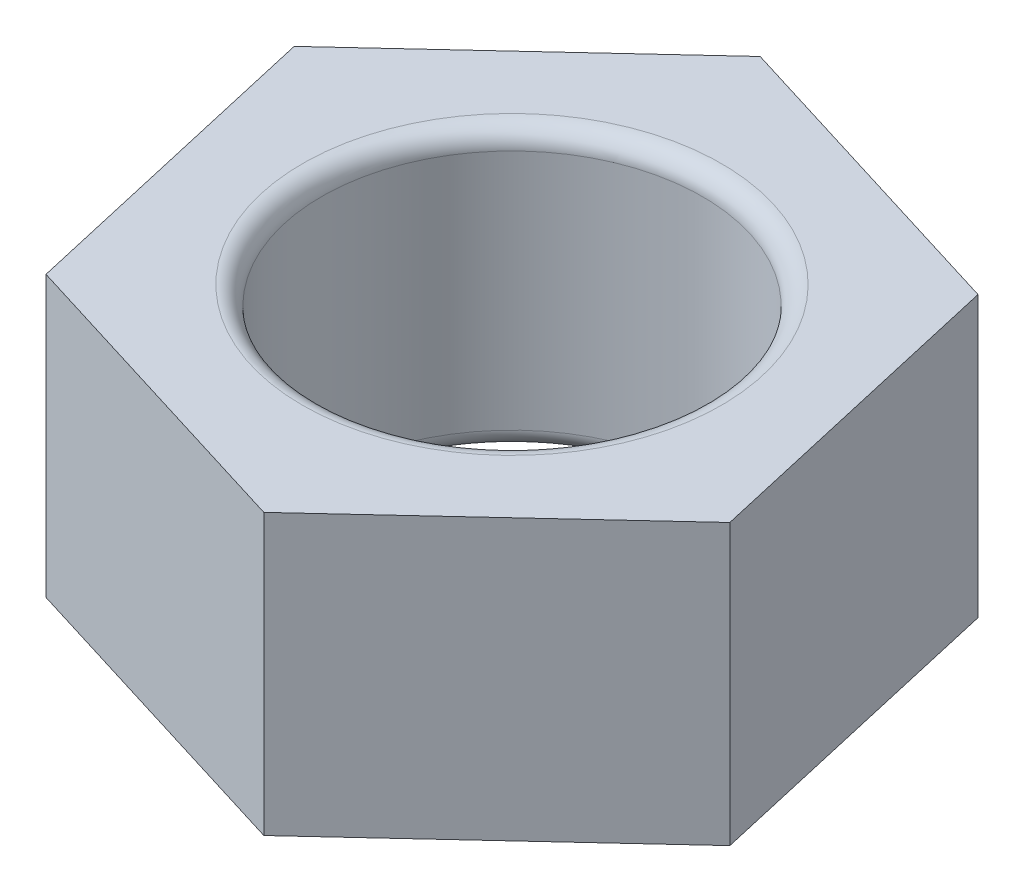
from build123d import *

# Parameters (mm, degrees)
SKETCH1_R           = 100
BOSS_EXTRUDE1_DEPTH = 147
FILLET1_R           = 10


with BuildPart() as part:
    # Sketch1 → Boss-Extrude1 (new body)
    with BuildSketch(Plane(origin=(0, 0, 0), x_dir=(1, 0, 0), z_dir=(0, 1, 0))):
        Polygon((165.5015584, -51.080663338), (126.987931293, 117.788222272), (-38.513627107, 168.86888561), (-165.5015584, 51.080663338), (-126.987931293, -117.788222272), (38.513627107, -168.86888561), align=None)
        with Locations(Location((0, 0, 0), (0, 0, 270))):
            Circle(SKETCH1_R, mode=Mode.SUBTRACT)
    extrude(amount=BOSS_EXTRUDE1_DEPTH)

    # Fillet1
    fillet1_edges = [part.edges().sort_by_distance(p)[0] for p in [
        (0, 0, -100),
        (0, 147, -100),
    ]]
    fillet(fillet1_edges, radius=FILLET1_R)


solid = part.part
